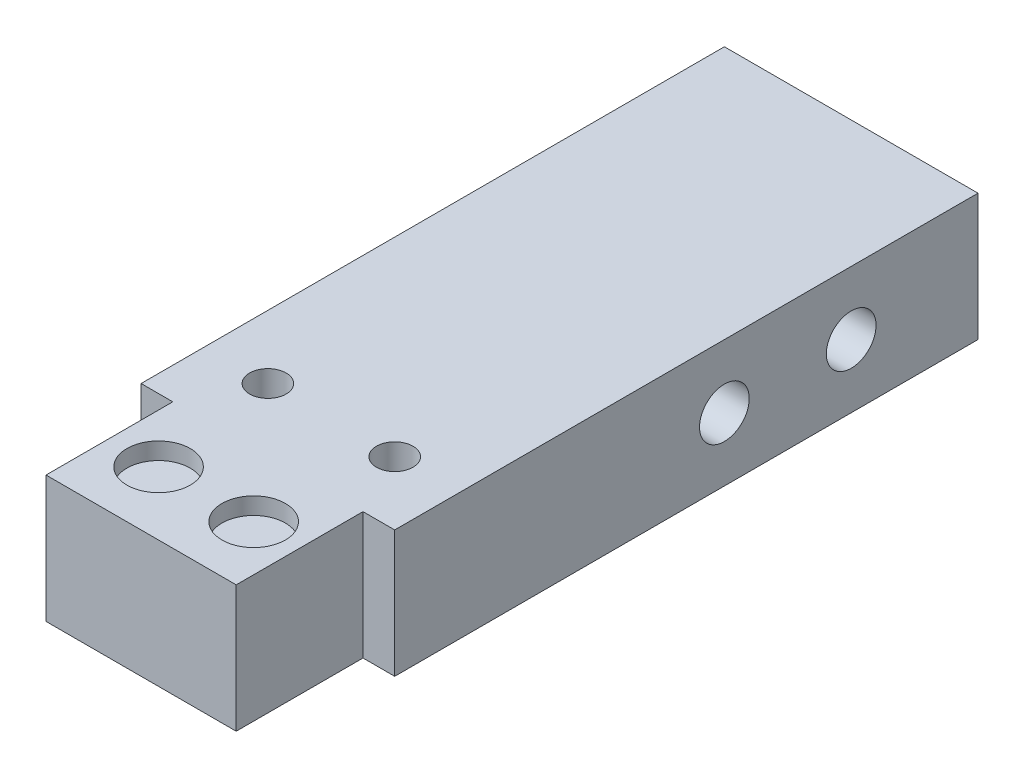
from build123d import *

# Parameters (mm, degrees)
BOSS_EXTRUDE1_DEPTH = 12.7
SKETCH5_W           = 3.175
SKETCH5_H           = 12.7
CUT_EXTRUDE4_DEPTH  = 12.7
SKETCH7_R           = 3.175
CUT_EXTRUDE5_DEPTH  = 1.7018
SKETCH8_W           = 25.4
SKETCH8_H           = 12.7
CUT_EXTRUDE6_DEPTH  = 17.78
SKETCH9_R           = 1.8288
CUT_EXTRUDE7_DEPTH  = 17.78
SKETCH10_R          = 2.4892
CUT_EXTRUDE8_DEPTH  = 25.4


with BuildPart() as part:
    # Sketch1 → Boss-Extrude1 (new, symmetric)
    with BuildSketch(Plane(origin=(0, 0, 0), x_dir=(0, 0, -1), z_dir=(1, 0, 0))):
        Polygon((-50.8, 22.86), (-50.8, 6.35), (-63.5, 6.35), (-63.5, -6.35), (7.62, -6.35), (7.62, 6.35), (-38.1, 6.35), align=None)
    extrude(amount=BOSS_EXTRUDE1_DEPTH, both=True)

    # Sketch5 → Cut-Extrude4 (cut)
    with BuildSketch(Plane(origin=(0, 6.35, 0), x_dir=(1, 0, 0), z_dir=(0, 1, 0))):
        with Locations((-11.1125, -57.15)):
            Rectangle(SKETCH5_W, SKETCH5_H)
        with Locations((11.1125, -57.15)):
            Rectangle(SKETCH5_W, SKETCH5_H)
    extrude(amount=-CUT_EXTRUDE4_DEPTH, mode=Mode.SUBTRACT)

    # Sketch7 → Cut-Extrude5 (cut)
    with BuildSketch(Plane(origin=(0, 6.35, 0), x_dir=(1, 0, 0), z_dir=(0, 1, 0))):
        with Locations(Location((-4.599523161, -57.15, 0), (0, 0, 270))):
            Circle(SKETCH7_R)
        with Locations(Location((4.925476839, -57.15, 0), (0, 0, 270))):
            Circle(SKETCH7_R)
    extrude(amount=-CUT_EXTRUDE5_DEPTH, mode=Mode.SUBTRACT)

    # Sketch8 → Cut-Extrude6 (cut)
    with BuildSketch(Plane(origin=(0, 6.35, 0), x_dir=(1, 0, 0), z_dir=(0, 1, 0))):
        with Locations((0, -44.45)):
            Rectangle(SKETCH8_W, SKETCH8_H)
    extrude(amount=CUT_EXTRUDE6_DEPTH, mode=Mode.SUBTRACT)

    # Sketch9 → Cut-Extrude7 (cut)
    with BuildSketch(Plane(origin=(0, 6.35, 0), x_dir=(1, 0, 0), z_dir=(0, 1, 0))):
        with Locations(Location((-6.35, -44.45, 0), (0, 0, 270))):
            Circle(SKETCH9_R)
        with Locations(Location((6.35, -44.45, 0), (0, 0, 270))):
            Circle(SKETCH9_R)
    extrude(amount=-CUT_EXTRUDE7_DEPTH, mode=Mode.SUBTRACT)

    # Sketch10 → Cut-Extrude8 (cut)
    with BuildSketch(Plane(origin=(12.7, 0, 0), x_dir=(0, 0, -1), z_dir=(1, 0, 0))):
        with Locations((-17.78, 0)):
            Circle(SKETCH10_R)
        with Locations((-5.08, 0)):
            Circle(SKETCH10_R)
    extrude(amount=-CUT_EXTRUDE8_DEPTH, mode=Mode.SUBTRACT)


solid = part.part
